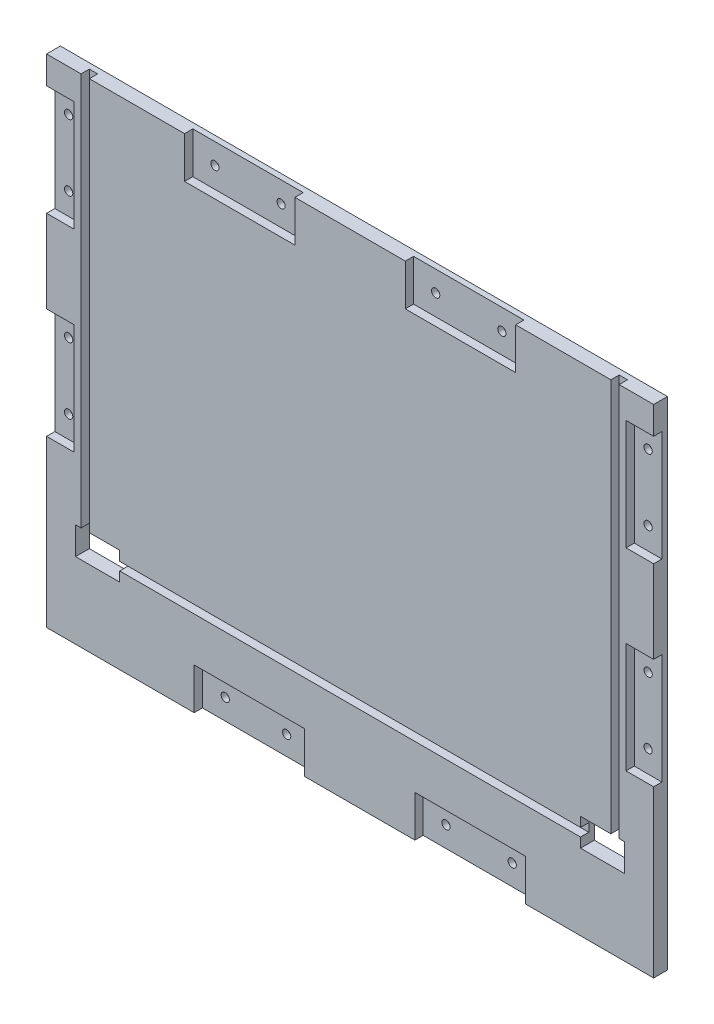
from build123d import *

# Parameters (mm, degrees)
ESQUISSE1_W             = 220
ESQUISSE1_H             = 180
ESQUISSE1_W_2           = 16
ESQUISSE1_H_2           = 10
EXTRUSION1_DEPTH        = 5
ESQUISSE2_W             = 167
ESQUISSE2_H             = 3
ESQUISSE2_W_2           = 3
ESQUISSE2_H_2           = 142.5
ENL_V_MAT_EXTRU_1_DEPTH = 3
ESQUISSE3_W             = 40
ESQUISSE3_H             = 15
ESQUISSE3_W_2           = 10
ESQUISSE3_H_2           = 40
ENL_V_MAT_EXTRU_2_DEPTH = 3
ESQUISSE4_R             = 1.5
ENL_V_MAT_EXTRU_3_DEPTH = 285.297379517


with BuildPart() as part:
    # Esquisse1 → Extrusion1 (new body)
    with BuildSketch(Plane.XY):
        with Locations((110, 90)):
            Rectangle(ESQUISSE1_W, ESQUISSE1_H)
        with Locations((201.5, 32.5)):
            Rectangle(ESQUISSE1_W_2, ESQUISSE1_H_2, mode=Mode.SUBTRACT)
        with Locations((18.5, 32.5)):
            Rectangle(ESQUISSE1_W_2, ESQUISSE1_H_2, mode=Mode.SUBTRACT)
    extrude(amount=EXTRUSION1_DEPTH)

    # Esquisse2 → Enl_v. mat.-Extru.1 (cut)
    with BuildSketch(Plane.XY.offset(5)):
        with Locations((110, 32.5)):
            Rectangle(ESQUISSE2_W, ESQUISSE2_H)
        with Locations((206, 108.75)):
            Rectangle(ESQUISSE2_W_2, ESQUISSE2_H_2)
        with Locations((14, 108.75)):
            Rectangle(ESQUISSE2_W_2, ESQUISSE2_H_2)
    extrude(amount=-ENL_V_MAT_EXTRU_1_DEPTH, mode=Mode.SUBTRACT)

    # Esquisse3 → Enl_v. mat.-Extru.2 (cut)
    with BuildSketch(Plane.XY.offset(5)):
        with Locations((150, 172.5)):
            Rectangle(ESQUISSE3_W, ESQUISSE3_H)
        with Locations((215, 150)):
            Rectangle(ESQUISSE3_W_2, ESQUISSE3_H_2)
        with Locations((153.481399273, 7.5)):
            Rectangle(ESQUISSE3_W, ESQUISSE3_H)
        with Locations((215, 80)):
            Rectangle(ESQUISSE3_W_2, ESQUISSE3_H_2)
        with Locations((73.481399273, 7.5)):
            Rectangle(ESQUISSE3_W, ESQUISSE3_H)
        with Locations((5, 80)):
            Rectangle(ESQUISSE3_W_2, ESQUISSE3_H_2)
        with Locations((5, 150)):
            Rectangle(ESQUISSE3_W_2, ESQUISSE3_H_2)
        with Locations((70, 172.5)):
            Rectangle(ESQUISSE3_W, ESQUISSE3_H)
    extrude(amount=-ENL_V_MAT_EXTRU_2_DEPTH, mode=Mode.SUBTRACT)

    # Esquisse4 → Enl_v. mat.-Extru.3 (cut, through all)
    with BuildSketch(Plane.XY.offset(5)):
        with Locations((138, 172.5)):
            Circle(ESQUISSE4_R)
        with Locations((162, 172.5)):
            Circle(ESQUISSE4_R)
        with Locations(Location((215, 162, 0), (0, 0, 180))):
            Circle(ESQUISSE4_R)
        with Locations((215, 138)):
            Circle(ESQUISSE4_R)
        with Locations(Location((215, 92, 0), (0, 0, 180))):
            Circle(ESQUISSE4_R)
        with Locations((215, 68)):
            Circle(ESQUISSE4_R)
        with Locations((141.753720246, 7.479643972)):
            Circle(ESQUISSE4_R)
        with Locations((165.753720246, 7.479643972)):
            Circle(ESQUISSE4_R)
        with Locations((61.753720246, 7.479643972)):
            Circle(ESQUISSE4_R)
        with Locations((84, 7)):
            Circle(ESQUISSE4_R)
        with Locations(Location((5, 68, 0), (0, 0, 180))):
            Circle(ESQUISSE4_R)
        with Locations((5, 92)):
            Circle(ESQUISSE4_R)
        with Locations(Location((5, 138, 0), (0, 0, 180))):
            Circle(ESQUISSE4_R)
        with Locations((5, 162)):
            Circle(ESQUISSE4_R)
        with Locations((58, 172.5)):
            Circle(ESQUISSE4_R)
        with Locations((82, 172.5)):
            Circle(ESQUISSE4_R)
    extrude(amount=-ENL_V_MAT_EXTRU_3_DEPTH, mode=Mode.SUBTRACT)


solid = part.part
